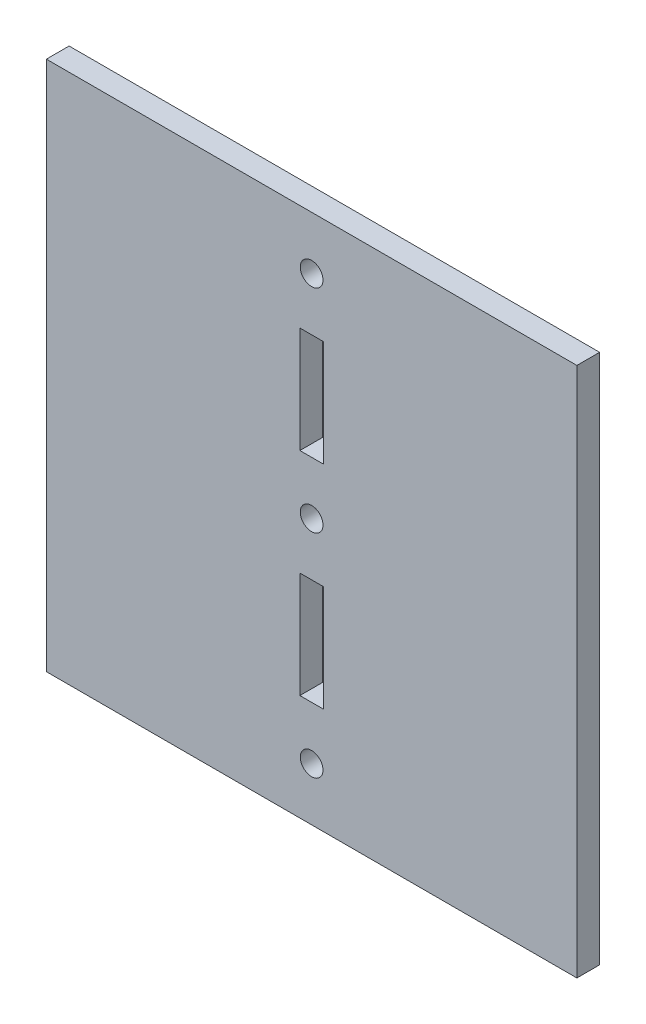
from build123d import *

# Parameters (mm, degrees)
SKETCH1_W           = 70
SKETCH1_H           = 70
SKETCH1_R           = 1.5
SKETCH1_W_2         = 3.1
SKETCH1_H_2         = 14
BOSS_EXTRUDE1_DEPTH = 3


with BuildPart() as part:
    # Sketch1 → Boss-Extrude1 (new body)
    with BuildSketch(Plane.XY):
        Rectangle(SKETCH1_W, SKETCH1_H)
        Circle(SKETCH1_R, mode=Mode.SUBTRACT)
        with Locations((0, 28)):
            Circle(SKETCH1_R, mode=Mode.SUBTRACT)
        with Locations((0, -28)):
            Circle(SKETCH1_R, mode=Mode.SUBTRACT)
        with Locations((0, 14)):
            Rectangle(SKETCH1_W_2, SKETCH1_H_2, mode=Mode.SUBTRACT)
        with Locations((0, -14)):
            Rectangle(SKETCH1_W_2, SKETCH1_H_2, mode=Mode.SUBTRACT)
    extrude(amount=BOSS_EXTRUDE1_DEPTH)


solid = part.part
